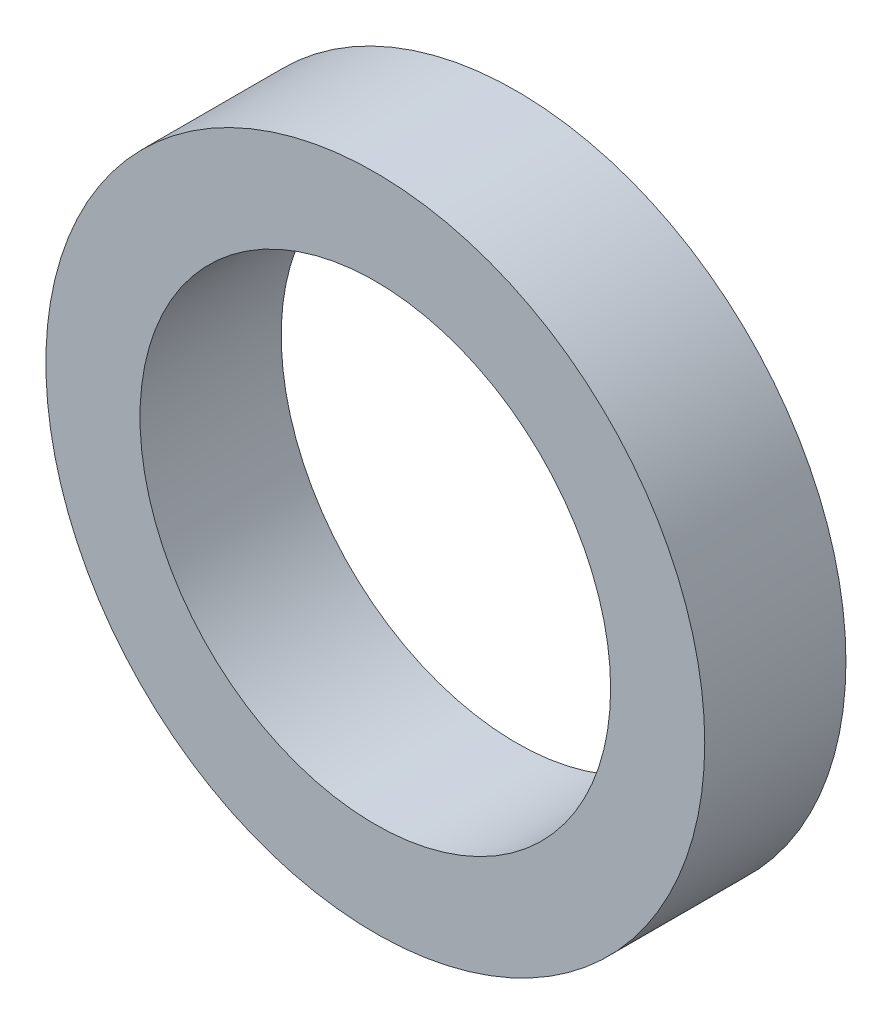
ISO-10303-21;
HEADER;
FILE_DESCRIPTION(('STEP AP214'),'2;1');
FILE_NAME('part.step','',(''),(''),'','','');
FILE_SCHEMA(('AUTOMOTIVE_DESIGN { 1 0 10303 214 1 1 1 1 }'));
ENDSEC;
DATA;
#1=APPLICATION_CONTEXT('core data for automotive mechanical design processes');
#2=APPLICATION_PROTOCOL_DEFINITION('international standard','automotive_design',2000,#1);
#3=PRODUCT_CONTEXT('',#1,'mechanical');
#4=PRODUCT('Part','Part','',(#3));
#5=PRODUCT_RELATED_PRODUCT_CATEGORY('part','',(#4));
#6=PRODUCT_DEFINITION_FORMATION('','',#4);
#7=PRODUCT_DEFINITION_CONTEXT('part definition',#1,'design');
#8=PRODUCT_DEFINITION('design','',#6,#7);
#9=PRODUCT_DEFINITION_SHAPE('','',#8);
#10=(LENGTH_UNIT() NAMED_UNIT(*) SI_UNIT(.MILLI.,.METRE.));
#11=(NAMED_UNIT(*) PLANE_ANGLE_UNIT() SI_UNIT($,.RADIAN.));
#12=(NAMED_UNIT(*) SI_UNIT($,.STERADIAN.) SOLID_ANGLE_UNIT());
#13=UNCERTAINTY_MEASURE_WITH_UNIT(LENGTH_MEASURE(1.E-05),#10,'distance_accuracy_value','');
#14=(GEOMETRIC_REPRESENTATION_CONTEXT(3) GLOBAL_UNCERTAINTY_ASSIGNED_CONTEXT((#13)) GLOBAL_UNIT_ASSIGNED_CONTEXT((#10,
#11,#12)) REPRESENTATION_CONTEXT('',''));
#15=CARTESIAN_POINT('',(0.,0.,0.));
#16=DIRECTION('',(0.,0.,1.));
#17=DIRECTION('',(1.,0.,0.));
#18=AXIS2_PLACEMENT_3D('',#15,#16,#17);
#19=CARTESIAN_POINT('',(0.,0.,3.));
#20=DIRECTION('',(0.,0.,-1.));
#21=DIRECTION('',(0.,1.,0.));
#22=AXIS2_PLACEMENT_3D('',#19,#20,#21);
#23=CYLINDRICAL_SURFACE('',#22,5.);
#24=CARTESIAN_POINT('',(0.,0.,3.));
#25=DIRECTION('',(0.,0.,-1.));
#26=DIRECTION('',(1.,0.,0.));
#27=AXIS2_PLACEMENT_3D('',#24,#25,#26);
#28=CIRCLE('',#27,5.);
#29=CARTESIAN_POINT('',(5.,0.,3.));
#30=VERTEX_POINT('',#29);
#31=EDGE_CURVE('E8',#30,#30,#28,.T.);
#32=ORIENTED_EDGE('',*,*,#31,.F.);
#33=EDGE_LOOP('',(#32));
#34=FACE_BOUND('',#33,.T.);
#35=CARTESIAN_POINT('',(0.,0.,0.));
#36=DIRECTION('',(0.,0.,-1.));
#37=DIRECTION('',(1.,0.,0.));
#38=AXIS2_PLACEMENT_3D('',#35,#36,#37);
#39=CIRCLE('',#38,5.);
#40=CARTESIAN_POINT('',(5.,0.,0.));
#41=VERTEX_POINT('',#40);
#42=EDGE_CURVE('E23',#41,#41,#39,.T.);
#43=ORIENTED_EDGE('',*,*,#42,.T.);
#44=EDGE_LOOP('',(#43));
#45=FACE_BOUND('',#44,.T.);
#46=ADVANCED_FACE('F12',(#34,#45),#23,.F.);
#47=CARTESIAN_POINT('',(0.,0.,3.));
#48=DIRECTION('',(0.,0.,-1.));
#49=DIRECTION('',(0.,1.,0.));
#50=AXIS2_PLACEMENT_3D('',#47,#48,#49);
#51=CYLINDRICAL_SURFACE('',#50,7.);
#52=CARTESIAN_POINT('',(0.,0.,3.));
#53=DIRECTION('',(0.,0.,-1.));
#54=DIRECTION('',(1.,0.,0.));
#55=AXIS2_PLACEMENT_3D('',#52,#53,#54);
#56=CIRCLE('',#55,7.);
#57=CARTESIAN_POINT('',(7.,0.,3.));
#58=VERTEX_POINT('',#57);
#59=EDGE_CURVE('E19',#58,#58,#56,.T.);
#60=ORIENTED_EDGE('',*,*,#59,.T.);
#61=EDGE_LOOP('',(#60));
#62=FACE_BOUND('',#61,.T.);
#63=CARTESIAN_POINT('',(0.,0.,0.));
#64=DIRECTION('',(0.,0.,-1.));
#65=DIRECTION('',(1.,0.,0.));
#66=AXIS2_PLACEMENT_3D('',#63,#64,#65);
#67=CIRCLE('',#66,7.);
#68=CARTESIAN_POINT('',(7.,0.,0.));
#69=VERTEX_POINT('',#68);
#70=EDGE_CURVE('E28',#69,#69,#67,.T.);
#71=ORIENTED_EDGE('',*,*,#70,.F.);
#72=EDGE_LOOP('',(#71));
#73=FACE_BOUND('',#72,.T.);
#74=ADVANCED_FACE('F14',(#62,#73),#51,.T.);
#75=CARTESIAN_POINT('',(0.,0.,3.));
#76=DIRECTION('',(0.,0.,-1.));
#77=DIRECTION('',(0.,1.,0.));
#78=AXIS2_PLACEMENT_3D('',#75,#76,#77);
#79=PLANE('',#78);
#80=ORIENTED_EDGE('',*,*,#31,.T.);
#81=EDGE_LOOP('',(#80));
#82=FACE_BOUND('',#81,.T.);
#83=ORIENTED_EDGE('',*,*,#59,.F.);
#84=EDGE_LOOP('',(#83));
#85=FACE_BOUND('',#84,.T.);
#86=ADVANCED_FACE('F40',(#82,#85),#79,.F.);
#87=CARTESIAN_POINT('',(0.,0.,0.));
#88=DIRECTION('',(0.,0.,-1.));
#89=DIRECTION('',(0.,1.,0.));
#90=AXIS2_PLACEMENT_3D('',#87,#88,#89);
#91=PLANE('',#90);
#92=ORIENTED_EDGE('',*,*,#42,.F.);
#93=EDGE_LOOP('',(#92));
#94=FACE_BOUND('',#93,.T.);
#95=ORIENTED_EDGE('',*,*,#70,.T.);
#96=EDGE_LOOP('',(#95));
#97=FACE_BOUND('',#96,.T.);
#98=ADVANCED_FACE('F37',(#94,#97),#91,.T.);
#99=CLOSED_SHELL('',(#46,#74,#86,#98));
#100=MANIFOLD_SOLID_BREP('B1',#99);
#101=ADVANCED_BREP_SHAPE_REPRESENTATION('',(#18,#100),#14);
#102=SHAPE_DEFINITION_REPRESENTATION(#9,#101);
ENDSEC;
END-ISO-10303-21;
